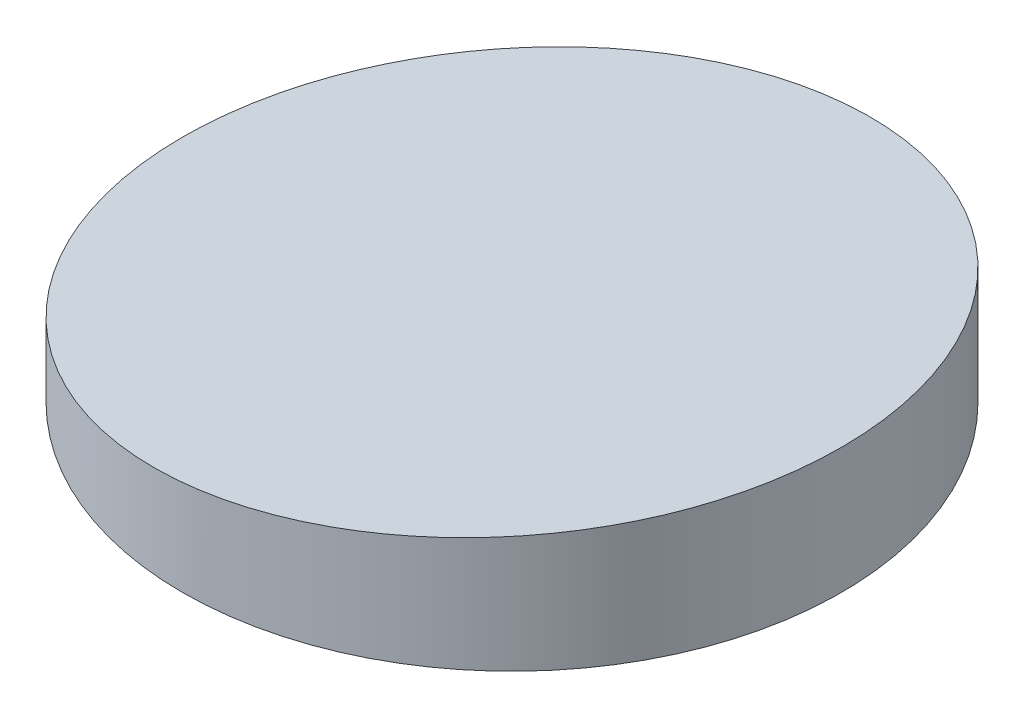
from build123d import *

# Parameters (mm, degrees)
SKETCH2_R               = 50.8
BOSS_EXTRUDE1_DEPTH     = 25.4
CUT_EXTRUDE1_DEPTH      = 77.2
CUT_EXTRUDE1_DEPTH_BACK = 77.2


with BuildPart() as part:
    # Sketch2 → Boss-Extrude1 (new body)
    with BuildSketch(Plane(origin=(0, 0, 0), x_dir=(1, 0, 0), z_dir=(0, 1, 0))):
        with Locations(Location((0, 0, 0), (0, 0, 270))):
            Circle(SKETCH2_R)
    extrude(amount=BOSS_EXTRUDE1_DEPTH)

    # Sketch4 → Cut-Extrude1 (cut, two sides: drawn at the far end of the back side and taken through both)
    with BuildSketch(Plane.XY.offset(-CUT_EXTRUDE1_DEPTH_BACK)):
        Polygon((-266.745312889, -9.936643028), (-50.8, 10), (50.8, 19.379980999), (266.745312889, 39.316624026), (226.872026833, 471.207249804), (-306.618598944, 421.95398275), align=None)
    extrude(amount=CUT_EXTRUDE1_DEPTH + CUT_EXTRUDE1_DEPTH_BACK, mode=Mode.SUBTRACT)


solid = part.part
